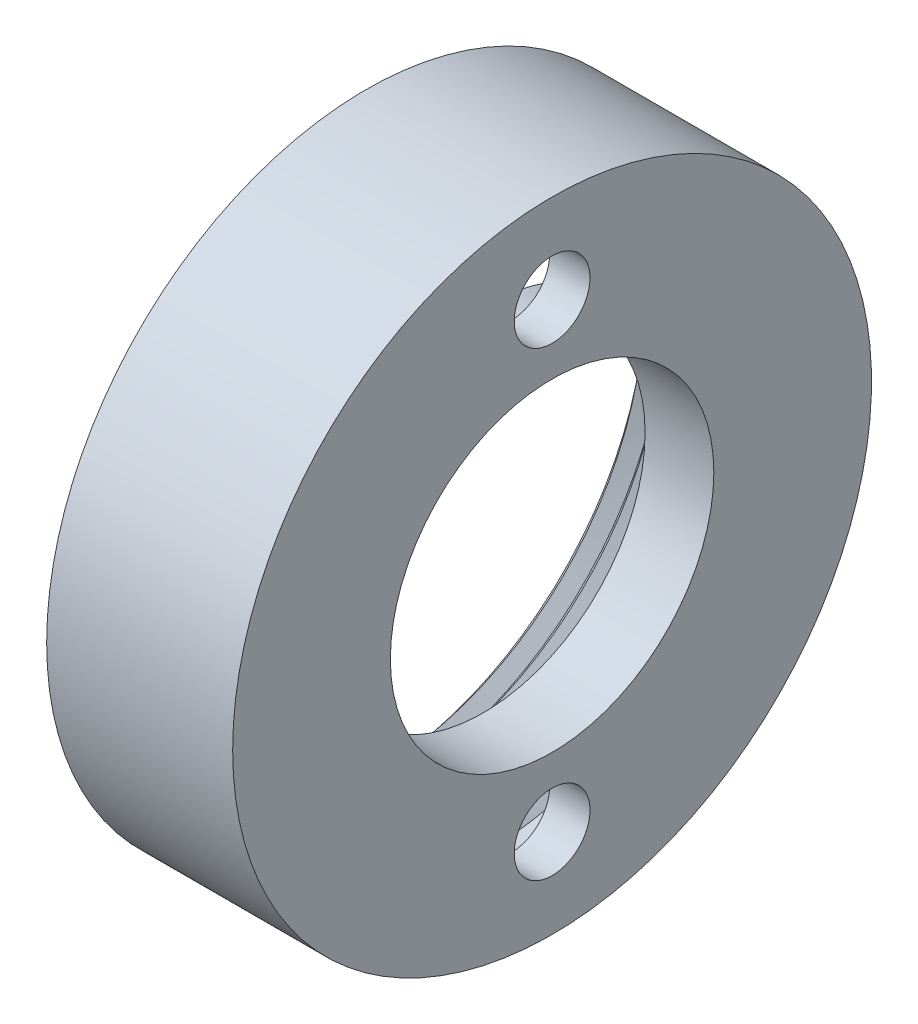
from build123d import *

# Parameters (mm, degrees)
SKETCH2_R          = 2.38125
CUT_EXTRUDE1_DEPTH = 31.688834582


with BuildPart() as part:
    # Sketch1 → Revolve1 (revolve)
    with BuildSketch(Plane.XY, mode=Mode.PRIVATE) as revolve1_sk:
        Polygon((0, 17.526), (0, 20.066), (11.684, 20.066), (11.684, 10.16), (7.366, 10.16), (7.366, 11.938), (9.144, 11.938), (9.144, 17.526), (7.62, 17.526), (6.985, 16.764), (6.35, 17.526), (5.715, 16.764), (5.08, 17.526), (4.445, 16.764), (3.81, 17.526), (3.175, 16.764), (2.54, 17.526), (1.905, 16.764), (1.27, 17.526), (0.635, 16.764), align=None)
    revolve(revolve1_sk.sketch.rotate(Axis((0, 0, 0), (1, 0, 0)), 90), axis=Axis((0, 0, 0), (1, 0, 0)))

    # Sketch2 → Cut-Extrude1 (cut, through all)
    with BuildSketch(Plane(origin=(11.684, 0, 0), x_dir=(0, 0, -1), z_dir=(1, 0, 0))):
        with Locations((0, 14.478)):
            Circle(SKETCH2_R)
        with Locations((0, -14.478)):
            Circle(SKETCH2_R)
    extrude(amount=-CUT_EXTRUDE1_DEPTH, mode=Mode.SUBTRACT)


solid = part.part
